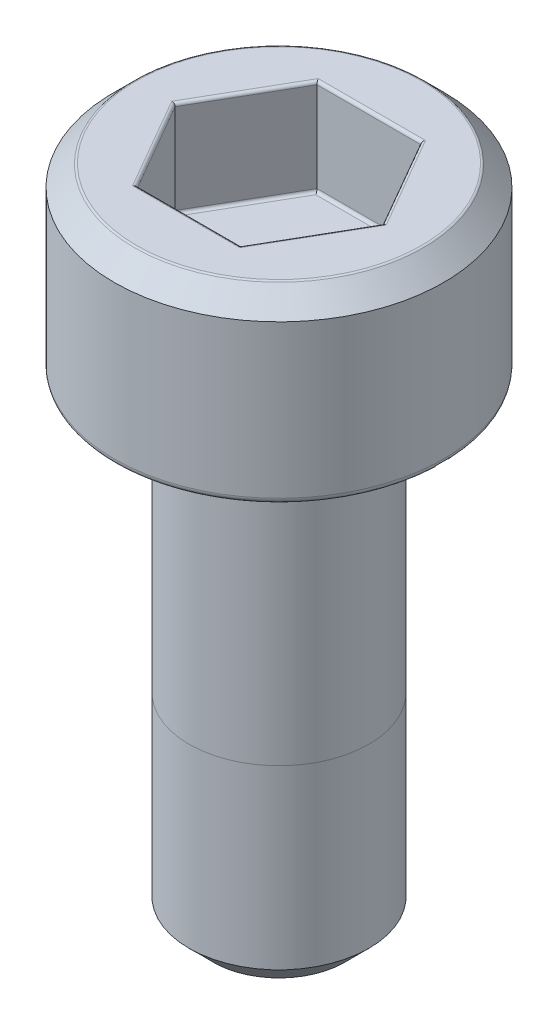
ISO-10303-21;
HEADER;
FILE_DESCRIPTION(('STEP AP214'),'2;1');
FILE_NAME('part.step','',(''),(''),'','','');
FILE_SCHEMA(('AUTOMOTIVE_DESIGN { 1 0 10303 214 1 1 1 1 }'));
ENDSEC;
DATA;
#1=APPLICATION_CONTEXT('core data for automotive mechanical design processes');
#2=APPLICATION_PROTOCOL_DEFINITION('international standard','automotive_design',2000,#1);
#3=PRODUCT_CONTEXT('',#1,'mechanical');
#4=PRODUCT('Part','Part','',(#3));
#5=PRODUCT_RELATED_PRODUCT_CATEGORY('part','',(#4));
#6=PRODUCT_DEFINITION_FORMATION('','',#4);
#7=PRODUCT_DEFINITION_CONTEXT('part definition',#1,'design');
#8=PRODUCT_DEFINITION('design','',#6,#7);
#9=PRODUCT_DEFINITION_SHAPE('','',#8);
#10=(LENGTH_UNIT() NAMED_UNIT(*) SI_UNIT(.MILLI.,.METRE.));
#11=(NAMED_UNIT(*) PLANE_ANGLE_UNIT() SI_UNIT($,.RADIAN.));
#12=(NAMED_UNIT(*) SI_UNIT($,.STERADIAN.) SOLID_ANGLE_UNIT());
#13=UNCERTAINTY_MEASURE_WITH_UNIT(LENGTH_MEASURE(1.E-05),#10,'distance_accuracy_value','');
#14=(GEOMETRIC_REPRESENTATION_CONTEXT(3) GLOBAL_UNCERTAINTY_ASSIGNED_CONTEXT((#13)) GLOBAL_UNIT_ASSIGNED_CONTEXT((#10,
#11,#12)) REPRESENTATION_CONTEXT('',''));
#15=CARTESIAN_POINT('',(0.,0.,0.));
#16=DIRECTION('',(0.,0.,1.));
#17=DIRECTION('',(1.,0.,0.));
#18=AXIS2_PLACEMENT_3D('',#15,#16,#17);
#19=CARTESIAN_POINT('',(0.,71.6279999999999,0.));
#20=DIRECTION('',(0.,1.,0.));
#21=DIRECTION('',(0.,0.,1.));
#22=AXIS2_PLACEMENT_3D('',#19,#20,#21);
#23=CYLINDRICAL_SURFACE('',#22,1.50000000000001);
#24=CARTESIAN_POINT('',(0.,-7.6,0.));
#25=DIRECTION('',(0.,-1.,0.));
#26=DIRECTION('',(0.,0.,-1.));
#27=AXIS2_PLACEMENT_3D('',#24,#25,#26);
#28=CIRCLE('',#27,1.50000000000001);
#29=CARTESIAN_POINT('',(0.,-7.6,-1.50000000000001));
#30=VERTEX_POINT('',#29);
#31=EDGE_CURVE('E294',#30,#30,#28,.F.);
#32=ORIENTED_EDGE('',*,*,#31,.T.);
#33=EDGE_LOOP('',(#32));
#34=FACE_BOUND('',#33,.T.);
#35=CARTESIAN_POINT('',(1.94289029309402E-13,-4.65,0.));
#36=DIRECTION('',(0.,1.,0.));
#37=DIRECTION('',(0.,0.,1.));
#38=AXIS2_PLACEMENT_3D('',#35,#36,#37);
#39=CIRCLE('',#38,1.50000000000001);
#40=CARTESIAN_POINT('',(1.94289029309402E-13,-4.65,1.50000000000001));
#41=VERTEX_POINT('',#40);
#42=EDGE_CURVE('E11',#41,#41,#39,.F.);
#43=ORIENTED_EDGE('',*,*,#42,.T.);
#44=EDGE_LOOP('',(#43));
#45=FACE_BOUND('',#44,.T.);
#46=ADVANCED_FACE('F36',(#34,#45),#23,.T.);
#47=CARTESIAN_POINT('',(0.,3.,0.));
#48=DIRECTION('',(0.,1.,0.));
#49=DIRECTION('',(0.,0.,1.));
#50=AXIS2_PLACEMENT_3D('',#47,#48,#49);
#51=PLANE('',#50);
#52=CARTESIAN_POINT('',(0.,3.,0.));
#53=DIRECTION('',(0.,1.,0.));
#54=DIRECTION('',(0.,0.,1.));
#55=AXIS2_PLACEMENT_3D('',#52,#53,#54);
#56=CIRCLE('',#55,2.37928932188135);
#57=CARTESIAN_POINT('',(0.,3.,2.37928932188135));
#58=VERTEX_POINT('',#57);
#59=EDGE_CURVE('E192',#58,#58,#56,.T.);
#60=ORIENTED_EDGE('',*,*,#59,.T.);
#61=EDGE_LOOP('',(#60));
#62=FACE_BOUND('',#61,.T.);
#63=DIRECTION('',(-0.5,0.,-0.866025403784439));
#64=VECTOR('',#63,1.);
#65=CARTESIAN_POINT('',(1.7753520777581,3.,-0.0249999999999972));
#66=LINE('',#65,#64);
#67=CARTESIAN_POINT('',(0.894892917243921,3.,-1.55));
#68=VERTEX_POINT('',#67);
#69=CARTESIAN_POINT('',(1.78978583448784,3.,0.));
#70=VERTEX_POINT('',#69);
#71=EDGE_CURVE('E52',#68,#70,#66,.F.);
#72=ORIENTED_EDGE('',*,*,#71,.T.);
#73=DIRECTION('',(0.5,0.,-0.866025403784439));
#74=VECTOR('',#73,1.);
#75=CARTESIAN_POINT('',(0.90932667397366,3.,1.525));
#76=LINE('',#75,#74);
#77=CARTESIAN_POINT('',(0.894892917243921,3.,1.55));
#78=VERTEX_POINT('',#77);
#79=EDGE_CURVE('E190',#70,#78,#76,.F.);
#80=ORIENTED_EDGE('',*,*,#79,.T.);
#81=DIRECTION('',(1.,0.,0.));
#82=VECTOR('',#81,1.);
#83=CARTESIAN_POINT('',(-0.866025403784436,3.,1.55));
#84=LINE('',#83,#82);
#85=CARTESIAN_POINT('',(-0.894892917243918,3.,1.55));
#86=VERTEX_POINT('',#85);
#87=EDGE_CURVE('E182',#78,#86,#84,.F.);
#88=ORIENTED_EDGE('',*,*,#87,.T.);
#89=DIRECTION('',(0.5,0.,0.866025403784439));
#90=VECTOR('',#89,1.);
#91=CARTESIAN_POINT('',(-1.7753520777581,3.,0.0249999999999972));
#92=LINE('',#91,#90);
#93=CARTESIAN_POINT('',(-1.78978583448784,3.,0.));
#94=VERTEX_POINT('',#93);
#95=EDGE_CURVE('E184',#86,#94,#92,.F.);
#96=ORIENTED_EDGE('',*,*,#95,.T.);
#97=DIRECTION('',(-0.5,0.,0.866025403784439));
#98=VECTOR('',#97,1.);
#99=CARTESIAN_POINT('',(-0.90932667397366,3.,-1.525));
#100=LINE('',#99,#98);
#101=CARTESIAN_POINT('',(-0.894892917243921,3.,-1.55));
#102=VERTEX_POINT('',#101);
#103=EDGE_CURVE('E186',#94,#102,#100,.F.);
#104=ORIENTED_EDGE('',*,*,#103,.T.);
#105=DIRECTION('',(-1.,0.,0.));
#106=VECTOR('',#105,1.);
#107=CARTESIAN_POINT('',(0.866025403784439,3.,-1.55));
#108=LINE('',#107,#106);
#109=EDGE_CURVE('E57',#102,#68,#108,.F.);
#110=ORIENTED_EDGE('',*,*,#109,.T.);
#111=EDGE_LOOP('',(#72,#80,#88,#96,#104,#110));
#112=FACE_BOUND('',#111,.T.);
#113=ADVANCED_FACE('F38',(#62,#112),#51,.T.);
#114=CARTESIAN_POINT('',(0.,71.6279999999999,0.));
#115=DIRECTION('',(0.,1.,0.));
#116=DIRECTION('',(0.,0.,1.));
#117=AXIS2_PLACEMENT_3D('',#114,#115,#116);
#118=CYLINDRICAL_SURFACE('',#117,2.75000000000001);
#119=CARTESIAN_POINT('',(0.,0.100000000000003,0.));
#120=DIRECTION('',(0.,-1.,0.));
#121=DIRECTION('',(0.,0.,-1.));
#122=AXIS2_PLACEMENT_3D('',#119,#120,#121);
#123=CIRCLE('',#122,2.75000000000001);
#124=CARTESIAN_POINT('',(0.,0.100000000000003,-2.75000000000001));
#125=VERTEX_POINT('',#124);
#126=EDGE_CURVE('E147',#125,#125,#123,.F.);
#127=ORIENTED_EDGE('',*,*,#126,.T.);
#128=EDGE_LOOP('',(#127));
#129=FACE_BOUND('',#128,.T.);
#130=CARTESIAN_POINT('',(0.,2.65,0.));
#131=DIRECTION('',(0.,1.,0.));
#132=DIRECTION('',(0.,0.,1.));
#133=AXIS2_PLACEMENT_3D('',#130,#131,#132);
#134=CIRCLE('',#133,2.75000000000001);
#135=CARTESIAN_POINT('',(0.,2.65,2.75000000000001));
#136=VERTEX_POINT('',#135);
#137=EDGE_CURVE('E277',#136,#136,#134,.F.);
#138=ORIENTED_EDGE('',*,*,#137,.T.);
#139=EDGE_LOOP('',(#138));
#140=FACE_BOUND('',#139,.T.);
#141=ADVANCED_FACE('F208',(#129,#140),#118,.T.);
#142=CARTESIAN_POINT('',(2.75000000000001,0.,0.));
#143=DIRECTION('',(0.,-1.,0.));
#144=DIRECTION('',(0.,0.,-1.));
#145=AXIS2_PLACEMENT_3D('',#142,#143,#144);
#146=PLANE('',#145);
#147=CARTESIAN_POINT('',(0.,0.,0.));
#148=DIRECTION('',(0.,-1.,0.));
#149=DIRECTION('',(0.,0.,-1.));
#150=AXIS2_PLACEMENT_3D('',#147,#148,#149);
#151=CIRCLE('',#150,1.60000000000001);
#152=CARTESIAN_POINT('',(0.,0.,-1.60000000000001));
#153=VERTEX_POINT('',#152);
#154=EDGE_CURVE('E239',#153,#153,#151,.F.);
#155=ORIENTED_EDGE('',*,*,#154,.T.);
#156=EDGE_LOOP('',(#155));
#157=FACE_BOUND('',#156,.T.);
#158=CARTESIAN_POINT('',(0.,0.,0.));
#159=DIRECTION('',(0.,-1.,0.));
#160=DIRECTION('',(0.,0.,-1.));
#161=AXIS2_PLACEMENT_3D('',#158,#159,#160);
#162=CIRCLE('',#161,2.65000000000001);
#163=CARTESIAN_POINT('',(0.,0.,-2.65000000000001));
#164=VERTEX_POINT('',#163);
#165=EDGE_CURVE('E244',#164,#164,#162,.T.);
#166=ORIENTED_EDGE('',*,*,#165,.T.);
#167=EDGE_LOOP('',(#166));
#168=FACE_BOUND('',#167,.T.);
#169=ADVANCED_FACE('F213',(#157,#168),#146,.T.);
#170=ORIENTED_EDGE('',*,*,#42,.F.);
#171=EDGE_LOOP('',(#170));
#172=FACE_BOUND('',#171,.T.);
#173=CARTESIAN_POINT('',(0.,-0.100000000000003,0.));
#174=DIRECTION('',(0.,-1.,0.));
#175=DIRECTION('',(0.,0.,-1.));
#176=AXIS2_PLACEMENT_3D('',#173,#174,#175);
#177=CIRCLE('',#176,1.50000000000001);
#178=CARTESIAN_POINT('',(0.,-0.100000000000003,-1.50000000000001));
#179=VERTEX_POINT('',#178);
#180=EDGE_CURVE('E237',#179,#179,#177,.T.);
#181=ORIENTED_EDGE('',*,*,#180,.T.);
#182=EDGE_LOOP('',(#181));
#183=FACE_BOUND('',#182,.T.);
#184=ADVANCED_FACE('F217',(#172,#183),#23,.T.);
#185=CARTESIAN_POINT('',(1.50000000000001,-8.,0.));
#186=DIRECTION('',(0.,-1.,0.));
#187=DIRECTION('',(0.,0.,-1.));
#188=AXIS2_PLACEMENT_3D('',#185,#186,#187);
#189=PLANE('',#188);
#190=CARTESIAN_POINT('',(0.,-8.,0.));
#191=DIRECTION('',(0.,-1.,0.));
#192=DIRECTION('',(0.,0.,-1.));
#193=AXIS2_PLACEMENT_3D('',#190,#191,#192);
#194=CIRCLE('',#193,1.1);
#195=CARTESIAN_POINT('',(0.,-8.,-1.1));
#196=VERTEX_POINT('',#195);
#197=EDGE_CURVE('E296',#196,#196,#194,.T.);
#198=ORIENTED_EDGE('',*,*,#197,.T.);
#199=EDGE_LOOP('',(#198));
#200=FACE_BOUND('',#199,.T.);
#201=ADVANCED_FACE('F225',(#200),#189,.T.);
#202=CARTESIAN_POINT('',(0.,3.,0.));
#203=DIRECTION('',(0.,-1.,0.));
#204=DIRECTION('',(0.,0.,-1.));
#205=AXIS2_PLACEMENT_3D('',#202,#203,#204);
#206=CONICAL_SURFACE('',#205,2.4,0.785398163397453);
#207=CARTESIAN_POINT('',(0.,2.98535533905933,0.));
#208=DIRECTION('',(0.,1.,0.));
#209=DIRECTION('',(0.,0.,1.));
#210=AXIS2_PLACEMENT_3D('',#207,#208,#209);
#211=CIRCLE('',#210,2.41464466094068);
#212=CARTESIAN_POINT('',(0.,2.98535533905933,2.41464466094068));
#213=VERTEX_POINT('',#212);
#214=EDGE_CURVE('E45',#213,#213,#211,.F.);
#215=ORIENTED_EDGE('',*,*,#214,.T.);
#216=EDGE_LOOP('',(#215));
#217=FACE_BOUND('',#216,.T.);
#218=ORIENTED_EDGE('',*,*,#137,.F.);
#219=EDGE_LOOP('',(#218));
#220=FACE_BOUND('',#219,.T.);
#221=ADVANCED_FACE('F197',(#217,#220),#206,.T.);
#222=CARTESIAN_POINT('',(0.,-7.6,0.));
#223=DIRECTION('',(0.,1.,0.));
#224=DIRECTION('',(0.,0.,1.));
#225=AXIS2_PLACEMENT_3D('',#222,#223,#224);
#226=CONICAL_SURFACE('',#225,1.50000000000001,0.785398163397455);
#227=ORIENTED_EDGE('',*,*,#197,.F.);
#228=EDGE_LOOP('',(#227));
#229=FACE_BOUND('',#228,.T.);
#230=ORIENTED_EDGE('',*,*,#31,.F.);
#231=EDGE_LOOP('',(#230));
#232=FACE_BOUND('',#231,.T.);
#233=ADVANCED_FACE('F312',(#229,#232),#226,.T.);
#234=CARTESIAN_POINT('',(0.,-0.100000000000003,0.));
#235=DIRECTION('',(0.,-1.,0.));
#236=DIRECTION('',(0.,0.,-1.));
#237=AXIS2_PLACEMENT_3D('',#234,#235,#236);
#238=TOROIDAL_SURFACE('',#237,1.60000000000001,0.1);
#239=ORIENTED_EDGE('',*,*,#180,.F.);
#240=EDGE_LOOP('',(#239));
#241=FACE_BOUND('',#240,.T.);
#242=ORIENTED_EDGE('',*,*,#154,.F.);
#243=EDGE_LOOP('',(#242));
#244=FACE_BOUND('',#243,.T.);
#245=ADVANCED_FACE('F306',(#241,#244),#238,.F.);
#246=CARTESIAN_POINT('',(0.,0.100000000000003,0.));
#247=DIRECTION('',(0.,-1.,0.));
#248=DIRECTION('',(0.,0.,-1.));
#249=AXIS2_PLACEMENT_3D('',#246,#247,#248);
#250=TOROIDAL_SURFACE('',#249,2.65000000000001,0.1);
#251=ORIENTED_EDGE('',*,*,#165,.F.);
#252=EDGE_LOOP('',(#251));
#253=FACE_BOUND('',#252,.T.);
#254=ORIENTED_EDGE('',*,*,#126,.F.);
#255=EDGE_LOOP('',(#254));
#256=FACE_BOUND('',#255,.T.);
#257=ADVANCED_FACE('F302',(#253,#256),#250,.T.);
#258=CARTESIAN_POINT('',(-0.866025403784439,1.4,1.5));
#259=DIRECTION('',(0.,0.,1.));
#260=DIRECTION('',(1.,0.,0.));
#261=AXIS2_PLACEMENT_3D('',#258,#259,#260);
#262=PLANE('',#261);
#263=DIRECTION('',(0.,1.,0.));
#264=VECTOR('',#263,1.);
#265=CARTESIAN_POINT('',(0.866025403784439,1.4,1.5));
#266=LINE('',#265,#264);
#267=CARTESIAN_POINT('',(0.866025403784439,1.45,1.5));
#268=VERTEX_POINT('',#267);
#269=CARTESIAN_POINT('',(0.866025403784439,2.95,1.5));
#270=VERTEX_POINT('',#269);
#271=EDGE_CURVE('E273',#268,#270,#266,.T.);
#272=ORIENTED_EDGE('',*,*,#271,.F.);
#273=DIRECTION('',(1.,0.,0.));
#274=VECTOR('',#273,1.);
#275=CARTESIAN_POINT('',(-0.866025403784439,1.45,1.5));
#276=LINE('',#275,#274);
#277=CARTESIAN_POINT('',(-0.866025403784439,1.45,1.5));
#278=VERTEX_POINT('',#277);
#279=EDGE_CURVE('E180',#268,#278,#276,.F.);
#280=ORIENTED_EDGE('',*,*,#279,.T.);
#281=DIRECTION('',(0.,1.,0.));
#282=VECTOR('',#281,1.);
#283=CARTESIAN_POINT('',(-0.866025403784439,1.4,1.5));
#284=LINE('',#283,#282);
#285=CARTESIAN_POINT('',(-0.866025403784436,2.95,1.5));
#286=VERTEX_POINT('',#285);
#287=EDGE_CURVE('E274',#278,#286,#284,.T.);
#288=ORIENTED_EDGE('',*,*,#287,.T.);
#289=DIRECTION('',(1.,0.,0.));
#290=VECTOR('',#289,1.);
#291=CARTESIAN_POINT('',(0.866025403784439,2.95,1.5));
#292=LINE('',#291,#290);
#293=EDGE_CURVE('E178',#286,#270,#292,.T.);
#294=ORIENTED_EDGE('',*,*,#293,.T.);
#295=EDGE_LOOP('',(#272,#280,#288,#294));
#296=FACE_BOUND('',#295,.T.);
#297=ADVANCED_FACE('F305',(#296),#262,.F.);
#298=CARTESIAN_POINT('',(-1.73205080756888,1.4,0.));
#299=DIRECTION('',(-0.866025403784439,0.,0.5));
#300=DIRECTION('',(0.5,0.,0.866025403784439));
#301=AXIS2_PLACEMENT_3D('',#298,#299,#300);
#302=PLANE('',#301);
#303=ORIENTED_EDGE('',*,*,#287,.F.);
#304=DIRECTION('',(0.5,0.,0.866025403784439));
#305=VECTOR('',#304,1.);
#306=CARTESIAN_POINT('',(-1.73205080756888,1.45,0.));
#307=LINE('',#306,#305);
#308=CARTESIAN_POINT('',(-1.73205080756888,1.45,0.));
#309=VERTEX_POINT('',#308);
#310=EDGE_CURVE('E133',#278,#309,#307,.F.);
#311=ORIENTED_EDGE('',*,*,#310,.T.);
#312=DIRECTION('',(0.,1.,0.));
#313=VECTOR('',#312,1.);
#314=CARTESIAN_POINT('',(-1.73205080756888,1.4,0.));
#315=LINE('',#314,#313);
#316=CARTESIAN_POINT('',(-1.73205080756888,2.95,0.));
#317=VERTEX_POINT('',#316);
#318=EDGE_CURVE('E278',#309,#317,#315,.T.);
#319=ORIENTED_EDGE('',*,*,#318,.T.);
#320=DIRECTION('',(0.5,0.,0.866025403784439));
#321=VECTOR('',#320,1.);
#322=CARTESIAN_POINT('',(-0.866025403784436,2.95,1.5));
#323=LINE('',#322,#321);
#324=EDGE_CURVE('E153',#317,#286,#323,.T.);
#325=ORIENTED_EDGE('',*,*,#324,.T.);
#326=EDGE_LOOP('',(#303,#311,#319,#325));
#327=FACE_BOUND('',#326,.T.);
#328=ADVANCED_FACE('F324',(#327),#302,.F.);
#329=CARTESIAN_POINT('',(-0.866025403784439,1.4,-1.5));
#330=DIRECTION('',(-0.866025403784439,0.,-0.5));
#331=DIRECTION('',(-0.5,0.,0.866025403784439));
#332=AXIS2_PLACEMENT_3D('',#329,#330,#331);
#333=PLANE('',#332);
#334=ORIENTED_EDGE('',*,*,#318,.F.);
#335=DIRECTION('',(-0.5,0.,0.866025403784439));
#336=VECTOR('',#335,1.);
#337=CARTESIAN_POINT('',(-0.866025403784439,1.45,-1.5));
#338=LINE('',#337,#336);
#339=CARTESIAN_POINT('',(-0.866025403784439,1.45,-1.5));
#340=VERTEX_POINT('',#339);
#341=EDGE_CURVE('E163',#309,#340,#338,.F.);
#342=ORIENTED_EDGE('',*,*,#341,.T.);
#343=DIRECTION('',(0.,1.,0.));
#344=VECTOR('',#343,1.);
#345=CARTESIAN_POINT('',(-0.866025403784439,1.4,-1.5));
#346=LINE('',#345,#344);
#347=CARTESIAN_POINT('',(-0.866025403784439,2.95,-1.5));
#348=VERTEX_POINT('',#347);
#349=EDGE_CURVE('E281',#340,#348,#346,.T.);
#350=ORIENTED_EDGE('',*,*,#349,.T.);
#351=DIRECTION('',(-0.5,0.,0.866025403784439));
#352=VECTOR('',#351,1.);
#353=CARTESIAN_POINT('',(-1.73205080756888,2.95,0.));
#354=LINE('',#353,#352);
#355=EDGE_CURVE('E161',#348,#317,#354,.T.);
#356=ORIENTED_EDGE('',*,*,#355,.T.);
#357=EDGE_LOOP('',(#334,#342,#350,#356));
#358=FACE_BOUND('',#357,.T.);
#359=ADVANCED_FACE('F337',(#358),#333,.F.);
#360=CARTESIAN_POINT('',(0.866025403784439,1.4,-1.5));
#361=DIRECTION('',(0.,0.,-1.));
#362=DIRECTION('',(-1.,0.,0.));
#363=AXIS2_PLACEMENT_3D('',#360,#361,#362);
#364=PLANE('',#363);
#365=ORIENTED_EDGE('',*,*,#349,.F.);
#366=DIRECTION('',(-1.,0.,0.));
#367=VECTOR('',#366,1.);
#368=CARTESIAN_POINT('',(0.866025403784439,1.45,-1.5));
#369=LINE('',#368,#367);
#370=CARTESIAN_POINT('',(0.866025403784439,1.45,-1.5));
#371=VERTEX_POINT('',#370);
#372=EDGE_CURVE('E167',#340,#371,#369,.F.);
#373=ORIENTED_EDGE('',*,*,#372,.T.);
#374=DIRECTION('',(0.,1.,0.));
#375=VECTOR('',#374,1.);
#376=CARTESIAN_POINT('',(0.866025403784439,1.4,-1.5));
#377=LINE('',#376,#375);
#378=CARTESIAN_POINT('',(0.866025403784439,2.95,-1.5));
#379=VERTEX_POINT('',#378);
#380=EDGE_CURVE('E284',#371,#379,#377,.T.);
#381=ORIENTED_EDGE('',*,*,#380,.T.);
#382=DIRECTION('',(-1.,0.,0.));
#383=VECTOR('',#382,1.);
#384=CARTESIAN_POINT('',(-0.866025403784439,2.95,-1.5));
#385=LINE('',#384,#383);
#386=EDGE_CURVE('E165',#379,#348,#385,.T.);
#387=ORIENTED_EDGE('',*,*,#386,.T.);
#388=EDGE_LOOP('',(#365,#373,#381,#387));
#389=FACE_BOUND('',#388,.T.);
#390=ADVANCED_FACE('F333',(#389),#364,.F.);
#391=CARTESIAN_POINT('',(1.73205080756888,1.4,0.));
#392=DIRECTION('',(0.866025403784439,0.,-0.5));
#393=DIRECTION('',(-0.5,0.,-0.866025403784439));
#394=AXIS2_PLACEMENT_3D('',#391,#392,#393);
#395=PLANE('',#394);
#396=ORIENTED_EDGE('',*,*,#380,.F.);
#397=DIRECTION('',(-0.5,0.,-0.866025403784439));
#398=VECTOR('',#397,1.);
#399=CARTESIAN_POINT('',(1.73205080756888,1.45,0.));
#400=LINE('',#399,#398);
#401=CARTESIAN_POINT('',(1.73205080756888,1.45,0.));
#402=VERTEX_POINT('',#401);
#403=EDGE_CURVE('E171',#371,#402,#400,.F.);
#404=ORIENTED_EDGE('',*,*,#403,.T.);
#405=DIRECTION('',(0.,1.,0.));
#406=VECTOR('',#405,1.);
#407=CARTESIAN_POINT('',(1.73205080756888,1.4,0.));
#408=LINE('',#407,#406);
#409=CARTESIAN_POINT('',(1.73205080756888,2.95,0.));
#410=VERTEX_POINT('',#409);
#411=EDGE_CURVE('E287',#402,#410,#408,.T.);
#412=ORIENTED_EDGE('',*,*,#411,.T.);
#413=DIRECTION('',(-0.5,0.,-0.866025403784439));
#414=VECTOR('',#413,1.);
#415=CARTESIAN_POINT('',(0.866025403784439,2.95,-1.5));
#416=LINE('',#415,#414);
#417=EDGE_CURVE('E169',#410,#379,#416,.T.);
#418=ORIENTED_EDGE('',*,*,#417,.T.);
#419=EDGE_LOOP('',(#396,#404,#412,#418));
#420=FACE_BOUND('',#419,.T.);
#421=ADVANCED_FACE('F329',(#420),#395,.F.);
#422=CARTESIAN_POINT('',(0.866025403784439,1.4,1.5));
#423=DIRECTION('',(0.866025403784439,0.,0.5));
#424=DIRECTION('',(0.5,0.,-0.866025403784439));
#425=AXIS2_PLACEMENT_3D('',#422,#423,#424);
#426=PLANE('',#425);
#427=ORIENTED_EDGE('',*,*,#411,.F.);
#428=DIRECTION('',(0.5,0.,-0.866025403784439));
#429=VECTOR('',#428,1.);
#430=CARTESIAN_POINT('',(0.866025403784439,1.45,1.5));
#431=LINE('',#430,#429);
#432=EDGE_CURVE('E176',#402,#268,#431,.F.);
#433=ORIENTED_EDGE('',*,*,#432,.T.);
#434=ORIENTED_EDGE('',*,*,#271,.T.);
#435=DIRECTION('',(0.5,0.,-0.866025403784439));
#436=VECTOR('',#435,1.);
#437=CARTESIAN_POINT('',(1.73205080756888,2.95,0.));
#438=LINE('',#437,#436);
#439=EDGE_CURVE('E173',#270,#410,#438,.T.);
#440=ORIENTED_EDGE('',*,*,#439,.T.);
#441=EDGE_LOOP('',(#427,#433,#434,#440));
#442=FACE_BOUND('',#441,.T.);
#443=ADVANCED_FACE('F326',(#442),#426,.F.);
#444=CARTESIAN_POINT('',(2.59807621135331,1.4,1.5));
#445=DIRECTION('',(0.,1.,0.));
#446=DIRECTION('',(0.,0.,1.));
#447=AXIS2_PLACEMENT_3D('',#444,#445,#446);
#448=PLANE('',#447);
#449=DIRECTION('',(-0.5,0.,0.866025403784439));
#450=VECTOR('',#449,1.);
#451=CARTESIAN_POINT('',(-1.25573683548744,1.4,-0.724999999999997));
#452=LINE('',#451,#450);
#453=CARTESIAN_POINT('',(-0.837157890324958,1.4,-1.45));
#454=VERTEX_POINT('',#453);
#455=CARTESIAN_POINT('',(-1.67431578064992,1.4,0.));
#456=VERTEX_POINT('',#455);
#457=EDGE_CURVE('E151',#454,#456,#452,.T.);
#458=ORIENTED_EDGE('',*,*,#457,.T.);
#459=DIRECTION('',(0.5,0.,0.866025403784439));
#460=VECTOR('',#459,1.);
#461=CARTESIAN_POINT('',(0.0433012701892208,1.4,2.975));
#462=LINE('',#461,#460);
#463=CARTESIAN_POINT('',(-0.837157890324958,1.4,1.45));
#464=VERTEX_POINT('',#463);
#465=EDGE_CURVE('E131',#456,#464,#462,.T.);
#466=ORIENTED_EDGE('',*,*,#465,.T.);
#467=DIRECTION('',(1.,0.,0.));
#468=VECTOR('',#467,1.);
#469=CARTESIAN_POINT('',(2.59807621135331,1.4,1.45));
#470=LINE('',#469,#468);
#471=CARTESIAN_POINT('',(0.837157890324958,1.4,1.45));
#472=VERTEX_POINT('',#471);
#473=EDGE_CURVE('E140',#464,#472,#470,.T.);
#474=ORIENTED_EDGE('',*,*,#473,.T.);
#475=DIRECTION('',(0.5,0.,-0.866025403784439));
#476=VECTOR('',#475,1.);
#477=CARTESIAN_POINT('',(1.25573683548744,1.4,0.725000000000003));
#478=LINE('',#477,#476);
#479=CARTESIAN_POINT('',(1.67431578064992,1.4,0.));
#480=VERTEX_POINT('',#479);
#481=EDGE_CURVE('E146',#472,#480,#478,.T.);
#482=ORIENTED_EDGE('',*,*,#481,.T.);
#483=DIRECTION('',(-0.5,0.,-0.866025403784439));
#484=VECTOR('',#483,1.);
#485=CARTESIAN_POINT('',(2.55477494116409,1.4,1.525));
#486=LINE('',#485,#484);
#487=CARTESIAN_POINT('',(0.837157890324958,1.4,-1.45));
#488=VERTEX_POINT('',#487);
#489=EDGE_CURVE('E249',#480,#488,#486,.T.);
#490=ORIENTED_EDGE('',*,*,#489,.T.);
#491=DIRECTION('',(-1.,0.,0.));
#492=VECTOR('',#491,1.);
#493=CARTESIAN_POINT('',(2.59807621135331,1.4,-1.45));
#494=LINE('',#493,#492);
#495=EDGE_CURVE('E156',#488,#454,#494,.T.);
#496=ORIENTED_EDGE('',*,*,#495,.T.);
#497=EDGE_LOOP('',(#458,#466,#474,#482,#490,#496));
#498=FACE_BOUND('',#497,.T.);
#499=ADVANCED_FACE('F149',(#498),#448,.T.);
#500=CARTESIAN_POINT('',(2.55477494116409,1.45,1.525));
#501=DIRECTION('',(-0.5,0.,-0.866025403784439));
#502=DIRECTION('',(-0.866025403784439,0.,0.5));
#503=AXIS2_PLACEMENT_3D('',#500,#501,#502);
#504=CYLINDRICAL_SURFACE('',#503,0.05);
#505=CARTESIAN_POINT('',(1.67431578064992,1.45,0.));
#506=DIRECTION('',(0.,0.,-1.));
#507=DIRECTION('',(-1.,0.,0.));
#508=AXIS2_PLACEMENT_3D('',#505,#506,#507);
#509=ELLIPSE('',#508,0.0577350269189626,0.05);
#510=EDGE_CURVE('E262',#402,#480,#509,.T.);
#511=ORIENTED_EDGE('',*,*,#510,.F.);
#512=ORIENTED_EDGE('',*,*,#403,.F.);
#513=CARTESIAN_POINT('',(0.837157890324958,1.45,-1.45));
#514=DIRECTION('',(-0.866025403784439,0.,-0.5));
#515=DIRECTION('',(-0.5,0.,0.866025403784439));
#516=AXIS2_PLACEMENT_3D('',#513,#514,#515);
#517=ELLIPSE('',#516,0.0577350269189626,0.05);
#518=EDGE_CURVE('E271',#488,#371,#517,.F.);
#519=ORIENTED_EDGE('',*,*,#518,.F.);
#520=ORIENTED_EDGE('',*,*,#489,.F.);
#521=EDGE_LOOP('',(#511,#512,#519,#520));
#522=FACE_BOUND('',#521,.T.);
#523=ADVANCED_FACE('F347',(#522),#504,.F.);
#524=CARTESIAN_POINT('',(2.59807621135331,1.45,-1.45));
#525=DIRECTION('',(-1.,0.,0.));
#526=DIRECTION('',(0.,0.,1.));
#527=AXIS2_PLACEMENT_3D('',#524,#525,#526);
#528=CYLINDRICAL_SURFACE('',#527,0.05);
#529=ORIENTED_EDGE('',*,*,#518,.T.);
#530=ORIENTED_EDGE('',*,*,#372,.F.);
#531=CARTESIAN_POINT('',(-0.837157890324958,1.45,-1.45));
#532=DIRECTION('',(-0.866025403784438,0.,0.5));
#533=DIRECTION('',(0.5,0.,0.866025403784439));
#534=AXIS2_PLACEMENT_3D('',#531,#532,#533);
#535=ELLIPSE('',#534,0.0577350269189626,0.05);
#536=EDGE_CURVE('E258',#454,#340,#535,.F.);
#537=ORIENTED_EDGE('',*,*,#536,.F.);
#538=ORIENTED_EDGE('',*,*,#495,.F.);
#539=EDGE_LOOP('',(#529,#530,#537,#538));
#540=FACE_BOUND('',#539,.T.);
#541=ADVANCED_FACE('F259',(#540),#528,.F.);
#542=CARTESIAN_POINT('',(1.25573683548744,1.45,0.725000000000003));
#543=DIRECTION('',(0.5,0.,-0.866025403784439));
#544=DIRECTION('',(-0.866025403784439,0.,-0.5));
#545=AXIS2_PLACEMENT_3D('',#542,#543,#544);
#546=CYLINDRICAL_SURFACE('',#545,0.05);
#547=ORIENTED_EDGE('',*,*,#510,.T.);
#548=ORIENTED_EDGE('',*,*,#481,.F.);
#549=CARTESIAN_POINT('',(0.837157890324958,1.45,1.45));
#550=DIRECTION('',(0.866025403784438,0.,-0.5));
#551=DIRECTION('',(-0.5,0.,-0.866025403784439));
#552=AXIS2_PLACEMENT_3D('',#549,#550,#551);
#553=ELLIPSE('',#552,0.0577350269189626,0.05);
#554=EDGE_CURVE('E143',#268,#472,#553,.T.);
#555=ORIENTED_EDGE('',*,*,#554,.F.);
#556=ORIENTED_EDGE('',*,*,#432,.F.);
#557=EDGE_LOOP('',(#547,#548,#555,#556));
#558=FACE_BOUND('',#557,.T.);
#559=ADVANCED_FACE('F353',(#558),#546,.F.);
#560=CARTESIAN_POINT('',(-1.25573683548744,1.45,-0.724999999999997));
#561=DIRECTION('',(-0.5,0.,0.866025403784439));
#562=DIRECTION('',(0.866025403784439,0.,0.5));
#563=AXIS2_PLACEMENT_3D('',#560,#561,#562);
#564=CYLINDRICAL_SURFACE('',#563,0.05);
#565=ORIENTED_EDGE('',*,*,#536,.T.);
#566=ORIENTED_EDGE('',*,*,#341,.F.);
#567=CARTESIAN_POINT('',(-1.67431578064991,1.45,0.));
#568=DIRECTION('',(0.,0.,1.));
#569=DIRECTION('',(1.,0.,0.));
#570=AXIS2_PLACEMENT_3D('',#567,#568,#569);
#571=ELLIPSE('',#570,0.0577350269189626,0.05);
#572=EDGE_CURVE('E136',#456,#309,#571,.F.);
#573=ORIENTED_EDGE('',*,*,#572,.F.);
#574=ORIENTED_EDGE('',*,*,#457,.F.);
#575=EDGE_LOOP('',(#565,#566,#573,#574));
#576=FACE_BOUND('',#575,.T.);
#577=ADVANCED_FACE('F264',(#576),#564,.F.);
#578=CARTESIAN_POINT('',(2.59807621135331,1.45,1.45));
#579=DIRECTION('',(1.,0.,0.));
#580=DIRECTION('',(0.,0.,-1.));
#581=AXIS2_PLACEMENT_3D('',#578,#579,#580);
#582=CYLINDRICAL_SURFACE('',#581,0.05);
#583=ORIENTED_EDGE('',*,*,#554,.T.);
#584=ORIENTED_EDGE('',*,*,#473,.F.);
#585=CARTESIAN_POINT('',(-0.837157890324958,1.45,1.45));
#586=DIRECTION('',(0.866025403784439,0.,0.5));
#587=DIRECTION('',(-0.5,0.,0.866025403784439));
#588=AXIS2_PLACEMENT_3D('',#585,#586,#587);
#589=ELLIPSE('',#588,0.0577350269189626,0.05);
#590=EDGE_CURVE('E127',#278,#464,#589,.T.);
#591=ORIENTED_EDGE('',*,*,#590,.F.);
#592=ORIENTED_EDGE('',*,*,#279,.F.);
#593=EDGE_LOOP('',(#583,#584,#591,#592));
#594=FACE_BOUND('',#593,.T.);
#595=ADVANCED_FACE('F141',(#594),#582,.F.);
#596=CARTESIAN_POINT('',(0.0433012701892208,1.45,2.975));
#597=DIRECTION('',(0.5,0.,0.866025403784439));
#598=DIRECTION('',(0.866025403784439,0.,-0.5));
#599=AXIS2_PLACEMENT_3D('',#596,#597,#598);
#600=CYLINDRICAL_SURFACE('',#599,0.05);
#601=ORIENTED_EDGE('',*,*,#572,.T.);
#602=ORIENTED_EDGE('',*,*,#310,.F.);
#603=ORIENTED_EDGE('',*,*,#590,.T.);
#604=ORIENTED_EDGE('',*,*,#465,.F.);
#605=EDGE_LOOP('',(#601,#602,#603,#604));
#606=FACE_BOUND('',#605,.T.);
#607=ADVANCED_FACE('F129',(#606),#600,.F.);
#608=CARTESIAN_POINT('',(0.,2.95,0.));
#609=DIRECTION('',(0.,1.,0.));
#610=DIRECTION('',(0.,0.,1.));
#611=AXIS2_PLACEMENT_3D('',#608,#609,#610);
#612=TOROIDAL_SURFACE('',#611,2.37928932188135,0.05);
#613=ORIENTED_EDGE('',*,*,#214,.F.);
#614=EDGE_LOOP('',(#613));
#615=FACE_BOUND('',#614,.T.);
#616=ORIENTED_EDGE('',*,*,#59,.F.);
#617=EDGE_LOOP('',(#616));
#618=FACE_BOUND('',#617,.T.);
#619=ADVANCED_FACE('F200',(#615,#618),#612,.T.);
#620=CARTESIAN_POINT('',(-0.90932667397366,2.95,-1.525));
#621=DIRECTION('',(0.5,0.,-0.866025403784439));
#622=DIRECTION('',(-0.866025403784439,0.,-0.5));
#623=AXIS2_PLACEMENT_3D('',#620,#621,#622);
#624=CYLINDRICAL_SURFACE('',#623,0.05);
#625=CARTESIAN_POINT('',(-0.894892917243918,2.95,-1.55));
#626=DIRECTION('',(0.866025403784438,0.,-0.5));
#627=DIRECTION('',(0.5,0.,0.866025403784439));
#628=AXIS2_PLACEMENT_3D('',#625,#626,#627);
#629=ELLIPSE('',#628,0.0577350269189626,0.05);
#630=EDGE_CURVE('E405',#102,#348,#629,.T.);
#631=ORIENTED_EDGE('',*,*,#630,.F.);
#632=ORIENTED_EDGE('',*,*,#103,.F.);
#633=CARTESIAN_POINT('',(-1.78978583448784,2.95,0.));
#634=DIRECTION('',(0.,0.,-1.));
#635=DIRECTION('',(1.,0.,0.));
#636=AXIS2_PLACEMENT_3D('',#633,#634,#635);
#637=ELLIPSE('',#636,0.0577350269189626,0.05);
#638=EDGE_CURVE('E137',#317,#94,#637,.F.);
#639=ORIENTED_EDGE('',*,*,#638,.F.);
#640=ORIENTED_EDGE('',*,*,#355,.F.);
#641=EDGE_LOOP('',(#631,#632,#639,#640));
#642=FACE_BOUND('',#641,.T.);
#643=ADVANCED_FACE('F203',(#642),#624,.T.);
#644=CARTESIAN_POINT('',(-1.7753520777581,2.95,0.0249999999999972));
#645=DIRECTION('',(-0.5,0.,-0.866025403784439));
#646=DIRECTION('',(-0.866025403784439,0.,0.5));
#647=AXIS2_PLACEMENT_3D('',#644,#645,#646);
#648=CYLINDRICAL_SURFACE('',#647,0.05);
#649=ORIENTED_EDGE('',*,*,#638,.T.);
#650=ORIENTED_EDGE('',*,*,#95,.F.);
#651=CARTESIAN_POINT('',(-0.894892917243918,2.95,1.55));
#652=DIRECTION('',(-0.866025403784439,0.,-0.5));
#653=DIRECTION('',(0.5,0.,-0.866025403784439));
#654=AXIS2_PLACEMENT_3D('',#651,#652,#653);
#655=ELLIPSE('',#654,0.0577350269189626,0.05);
#656=EDGE_CURVE('E398',#286,#86,#655,.F.);
#657=ORIENTED_EDGE('',*,*,#656,.F.);
#658=ORIENTED_EDGE('',*,*,#324,.F.);
#659=EDGE_LOOP('',(#649,#650,#657,#658));
#660=FACE_BOUND('',#659,.T.);
#661=ADVANCED_FACE('F365',(#660),#648,.T.);
#662=CARTESIAN_POINT('',(0.866025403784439,2.95,-1.55));
#663=DIRECTION('',(1.,0.,0.));
#664=DIRECTION('',(0.,0.,-1.));
#665=AXIS2_PLACEMENT_3D('',#662,#663,#664);
#666=CYLINDRICAL_SURFACE('',#665,0.05);
#667=ORIENTED_EDGE('',*,*,#630,.T.);
#668=ORIENTED_EDGE('',*,*,#386,.F.);
#669=CARTESIAN_POINT('',(0.894892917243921,2.95,-1.55));
#670=DIRECTION('',(0.866025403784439,0.,0.5));
#671=DIRECTION('',(-0.5,0.,0.866025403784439));
#672=AXIS2_PLACEMENT_3D('',#669,#670,#671);
#673=ELLIPSE('',#672,0.0577350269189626,0.05);
#674=EDGE_CURVE('E393',#68,#379,#673,.T.);
#675=ORIENTED_EDGE('',*,*,#674,.F.);
#676=ORIENTED_EDGE('',*,*,#109,.F.);
#677=EDGE_LOOP('',(#667,#668,#675,#676));
#678=FACE_BOUND('',#677,.T.);
#679=ADVANCED_FACE('F369',(#678),#666,.T.);
#680=CARTESIAN_POINT('',(-0.866025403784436,2.95,1.55));
#681=DIRECTION('',(-1.,0.,0.));
#682=DIRECTION('',(0.,0.,1.));
#683=AXIS2_PLACEMENT_3D('',#680,#681,#682);
#684=CYLINDRICAL_SURFACE('',#683,0.05);
#685=ORIENTED_EDGE('',*,*,#656,.T.);
#686=ORIENTED_EDGE('',*,*,#87,.F.);
#687=CARTESIAN_POINT('',(0.894892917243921,2.95,1.55));
#688=DIRECTION('',(-0.866025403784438,0.,0.5));
#689=DIRECTION('',(0.5,0.,0.866025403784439));
#690=AXIS2_PLACEMENT_3D('',#687,#688,#689);
#691=ELLIPSE('',#690,0.0577350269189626,0.05);
#692=EDGE_CURVE('E389',#270,#78,#691,.F.);
#693=ORIENTED_EDGE('',*,*,#692,.F.);
#694=ORIENTED_EDGE('',*,*,#293,.F.);
#695=EDGE_LOOP('',(#685,#686,#693,#694));
#696=FACE_BOUND('',#695,.T.);
#697=ADVANCED_FACE('F373',(#696),#684,.T.);
#698=CARTESIAN_POINT('',(1.7753520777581,2.95,-0.0249999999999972));
#699=DIRECTION('',(0.5,0.,0.866025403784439));
#700=DIRECTION('',(0.866025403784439,0.,-0.5));
#701=AXIS2_PLACEMENT_3D('',#698,#699,#700);
#702=CYLINDRICAL_SURFACE('',#701,0.05);
#703=ORIENTED_EDGE('',*,*,#674,.T.);
#704=ORIENTED_EDGE('',*,*,#417,.F.);
#705=CARTESIAN_POINT('',(1.78978583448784,2.95,0.));
#706=DIRECTION('',(0.,0.,1.));
#707=DIRECTION('',(-1.,0.,0.));
#708=AXIS2_PLACEMENT_3D('',#705,#706,#707);
#709=ELLIPSE('',#708,0.0577350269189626,0.05);
#710=EDGE_CURVE('E394',#70,#410,#709,.T.);
#711=ORIENTED_EDGE('',*,*,#710,.F.);
#712=ORIENTED_EDGE('',*,*,#71,.F.);
#713=EDGE_LOOP('',(#703,#704,#711,#712));
#714=FACE_BOUND('',#713,.T.);
#715=ADVANCED_FACE('F377',(#714),#702,.T.);
#716=CARTESIAN_POINT('',(0.90932667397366,2.95,1.525));
#717=DIRECTION('',(-0.5,0.,0.866025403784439));
#718=DIRECTION('',(0.866025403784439,0.,0.5));
#719=AXIS2_PLACEMENT_3D('',#716,#717,#718);
#720=CYLINDRICAL_SURFACE('',#719,0.05);
#721=ORIENTED_EDGE('',*,*,#692,.T.);
#722=ORIENTED_EDGE('',*,*,#79,.F.);
#723=ORIENTED_EDGE('',*,*,#710,.T.);
#724=ORIENTED_EDGE('',*,*,#439,.F.);
#725=EDGE_LOOP('',(#721,#722,#723,#724));
#726=FACE_BOUND('',#725,.T.);
#727=ADVANCED_FACE('F381',(#726),#720,.T.);
#728=CLOSED_SHELL('',(#46,#113,#141,#169,#184,#201,#221,#233,#245,#257,#297,#328,#359,#390,#421,
#443,#499,#523,#541,#559,#577,#595,#607,#619,#643,#661,#679,#697,#715,#727));
#729=MANIFOLD_SOLID_BREP('B2',#728);
#730=ADVANCED_BREP_SHAPE_REPRESENTATION('',(#18,#729),#14);
#731=SHAPE_DEFINITION_REPRESENTATION(#9,#730);
ENDSEC;
END-ISO-10303-21;
